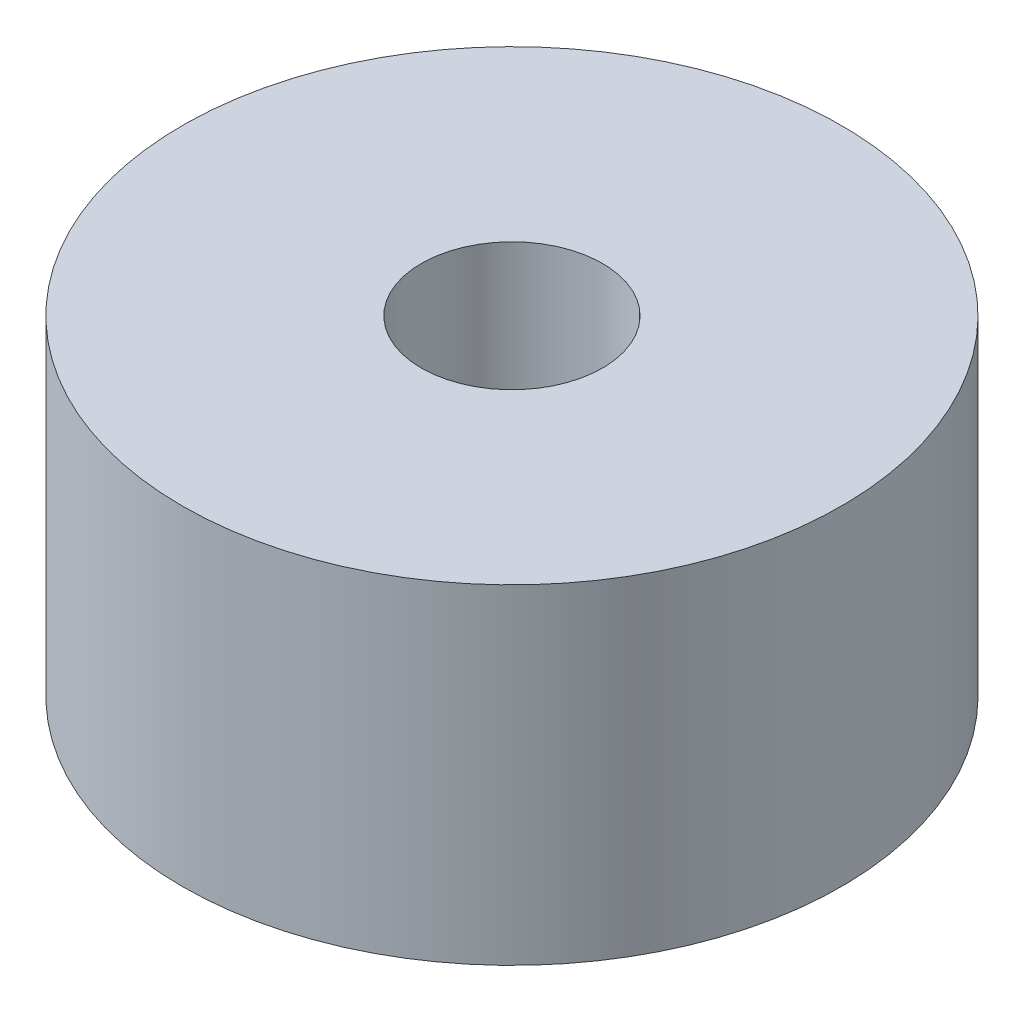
ISO-10303-21;
HEADER;
FILE_DESCRIPTION(('STEP AP214'),'2;1');
FILE_NAME('part.step','',(''),(''),'','','');
FILE_SCHEMA(('AUTOMOTIVE_DESIGN { 1 0 10303 214 1 1 1 1 }'));
ENDSEC;
DATA;
#1=APPLICATION_CONTEXT('core data for automotive mechanical design processes');
#2=APPLICATION_PROTOCOL_DEFINITION('international standard','automotive_design',2000,#1);
#3=PRODUCT_CONTEXT('',#1,'mechanical');
#4=PRODUCT('Part','Part','',(#3));
#5=PRODUCT_RELATED_PRODUCT_CATEGORY('part','',(#4));
#6=PRODUCT_DEFINITION_FORMATION('','',#4);
#7=PRODUCT_DEFINITION_CONTEXT('part definition',#1,'design');
#8=PRODUCT_DEFINITION('design','',#6,#7);
#9=PRODUCT_DEFINITION_SHAPE('','',#8);
#10=(LENGTH_UNIT() NAMED_UNIT(*) SI_UNIT(.MILLI.,.METRE.));
#11=(NAMED_UNIT(*) PLANE_ANGLE_UNIT() SI_UNIT($,.RADIAN.));
#12=(NAMED_UNIT(*) SI_UNIT($,.STERADIAN.) SOLID_ANGLE_UNIT());
#13=UNCERTAINTY_MEASURE_WITH_UNIT(LENGTH_MEASURE(1.E-05),#10,'distance_accuracy_value','');
#14=(GEOMETRIC_REPRESENTATION_CONTEXT(3) GLOBAL_UNCERTAINTY_ASSIGNED_CONTEXT((#13)) GLOBAL_UNIT_ASSIGNED_CONTEXT((#10,
#11,#12)) REPRESENTATION_CONTEXT('',''));
#15=CARTESIAN_POINT('',(0.,0.,0.));
#16=DIRECTION('',(0.,0.,1.));
#17=DIRECTION('',(1.,0.,0.));
#18=AXIS2_PLACEMENT_3D('',#15,#16,#17);
#19=CARTESIAN_POINT('',(-4.5,4.,0.));
#20=DIRECTION('',(0.,1.,0.));
#21=DIRECTION('',(0.,0.,1.));
#22=AXIS2_PLACEMENT_3D('',#19,#20,#21);
#23=PLANE('',#22);
#24=CARTESIAN_POINT('',(-4.5,4.,0.));
#25=DIRECTION('',(0.,1.,0.));
#26=DIRECTION('',(0.,0.,1.));
#27=AXIS2_PLACEMENT_3D('',#24,#25,#26);
#28=CIRCLE('',#27,4.);
#29=CARTESIAN_POINT('',(-4.5,4.,4.));
#30=VERTEX_POINT('',#29);
#31=EDGE_CURVE('E10',#30,#30,#28,.T.);
#32=ORIENTED_EDGE('',*,*,#31,.T.);
#33=EDGE_LOOP('',(#32));
#34=FACE_BOUND('',#33,.T.);
#35=CARTESIAN_POINT('',(-4.5,4.,0.));
#36=DIRECTION('',(0.,1.,0.));
#37=DIRECTION('',(0.,0.,1.));
#38=AXIS2_PLACEMENT_3D('',#35,#36,#37);
#39=CIRCLE('',#38,1.1);
#40=CARTESIAN_POINT('',(-4.5,4.,1.1));
#41=VERTEX_POINT('',#40);
#42=EDGE_CURVE('E42',#41,#41,#39,.T.);
#43=ORIENTED_EDGE('',*,*,#42,.F.);
#44=EDGE_LOOP('',(#43));
#45=FACE_BOUND('',#44,.T.);
#46=ADVANCED_FACE('F31',(#34,#45),#23,.T.);
#47=CARTESIAN_POINT('',(-4.5,0.,0.));
#48=DIRECTION('',(0.,1.,0.));
#49=DIRECTION('',(0.,0.,1.));
#50=AXIS2_PLACEMENT_3D('',#47,#48,#49);
#51=PLANE('',#50);
#52=CARTESIAN_POINT('',(-4.5,0.,0.));
#53=DIRECTION('',(0.,1.,0.));
#54=DIRECTION('',(0.,0.,1.));
#55=AXIS2_PLACEMENT_3D('',#52,#53,#54);
#56=CIRCLE('',#55,4.);
#57=CARTESIAN_POINT('',(-4.5,0.,4.));
#58=VERTEX_POINT('',#57);
#59=EDGE_CURVE('E35',#58,#58,#56,.T.);
#60=ORIENTED_EDGE('',*,*,#59,.F.);
#61=EDGE_LOOP('',(#60));
#62=FACE_BOUND('',#61,.T.);
#63=CARTESIAN_POINT('',(-4.5,0.,0.));
#64=DIRECTION('',(0.,1.,0.));
#65=DIRECTION('',(0.,0.,1.));
#66=AXIS2_PLACEMENT_3D('',#63,#64,#65);
#67=CIRCLE('',#66,1.1);
#68=CARTESIAN_POINT('',(-4.5,0.,1.1));
#69=VERTEX_POINT('',#68);
#70=EDGE_CURVE('E44',#69,#69,#67,.T.);
#71=ORIENTED_EDGE('',*,*,#70,.T.);
#72=EDGE_LOOP('',(#71));
#73=FACE_BOUND('',#72,.T.);
#74=ADVANCED_FACE('F54',(#62,#73),#51,.F.);
#75=CARTESIAN_POINT('',(-4.5,4.,0.));
#76=DIRECTION('',(0.,-1.,0.));
#77=DIRECTION('',(0.,0.,-1.));
#78=AXIS2_PLACEMENT_3D('',#75,#76,#77);
#79=CYLINDRICAL_SURFACE('',#78,4.);
#80=ORIENTED_EDGE('',*,*,#31,.F.);
#81=EDGE_LOOP('',(#80));
#82=FACE_BOUND('',#81,.T.);
#83=ORIENTED_EDGE('',*,*,#59,.T.);
#84=EDGE_LOOP('',(#83));
#85=FACE_BOUND('',#84,.T.);
#86=ADVANCED_FACE('F33',(#82,#85),#79,.T.);
#87=CARTESIAN_POINT('',(-4.5,4.,0.));
#88=DIRECTION('',(0.,-1.,0.));
#89=DIRECTION('',(0.,0.,-1.));
#90=AXIS2_PLACEMENT_3D('',#87,#88,#89);
#91=CYLINDRICAL_SURFACE('',#90,1.1);
#92=ORIENTED_EDGE('',*,*,#42,.T.);
#93=EDGE_LOOP('',(#92));
#94=FACE_BOUND('',#93,.T.);
#95=ORIENTED_EDGE('',*,*,#70,.F.);
#96=EDGE_LOOP('',(#95));
#97=FACE_BOUND('',#96,.T.);
#98=ADVANCED_FACE('F50',(#94,#97),#91,.F.);
#99=CLOSED_SHELL('',(#46,#74,#86,#98));
#100=MANIFOLD_SOLID_BREP('B2',#99);
#101=ADVANCED_BREP_SHAPE_REPRESENTATION('',(#18,#100),#14);
#102=SHAPE_DEFINITION_REPRESENTATION(#9,#101);
ENDSEC;
END-ISO-10303-21;
